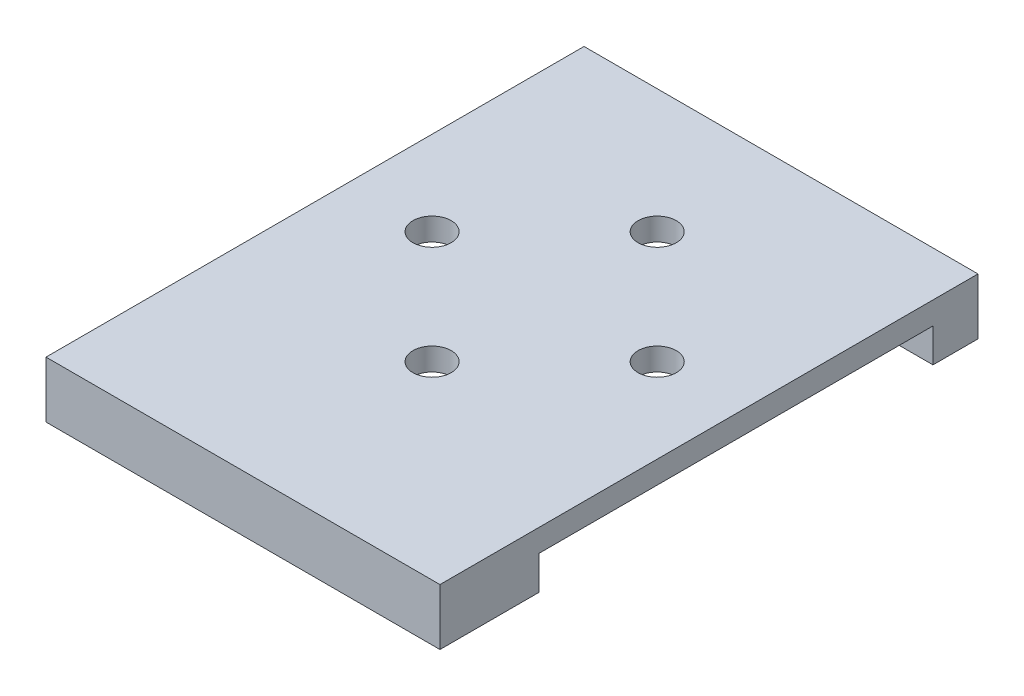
from build123d import *

# Parameters (mm, degrees)
SKETCH1_W           = 35
SKETCH1_H           = 47.8
BOSS_EXTRUDE1_DEPTH = 5
SKETCH2_R           = 1.7
CUT_EXTRUDE1_DEPTH  = 31.040972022
SKETCH3_W           = 35
SKETCH3_H           = 3
CUT_EXTRUDE2_DEPTH  = 43.675637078


with BuildPart() as part:
    # Sketch1 → Boss-Extrude1 (new body)
    with BuildSketch(Plane(origin=(0, 0, 0), x_dir=(1, 0, 0), z_dir=(0, 1, 0))):
        Rectangle(SKETCH1_W, SKETCH1_H)
    extrude(amount=BOSS_EXTRUDE1_DEPTH)

    # Sketch2 → Cut-Extrude1 (cut, through all)
    with BuildSketch(Plane(origin=(0, 5, 0), x_dir=(1, 0, 0), z_dir=(0, 1, 0))):
        with Locations(Location((0, 12.9, 0), (0, 0, 270))):
            Circle(SKETCH2_R)
        with Locations(Location((0, -7.1, 0), (0, 0, 270))):
            Circle(SKETCH2_R)
        with Locations(Location((10, 2.9, 0), (0, 0, 270))):
            Circle(SKETCH2_R)
        with Locations(Location((-10, 2.9, 0), (0, 0, 270))):
            Circle(SKETCH2_R)
    extrude(amount=-CUT_EXTRUDE1_DEPTH, mode=Mode.SUBTRACT)

    # Sketch3 → Cut-Extrude2 (cut, through all)
    with BuildSketch(Plane.ZY.offset(17.5)):
        with Locations((-2.4, 1.5)):
            Rectangle(SKETCH3_W, SKETCH3_H)
    extrude(amount=-CUT_EXTRUDE2_DEPTH, mode=Mode.SUBTRACT)


solid = part.part
